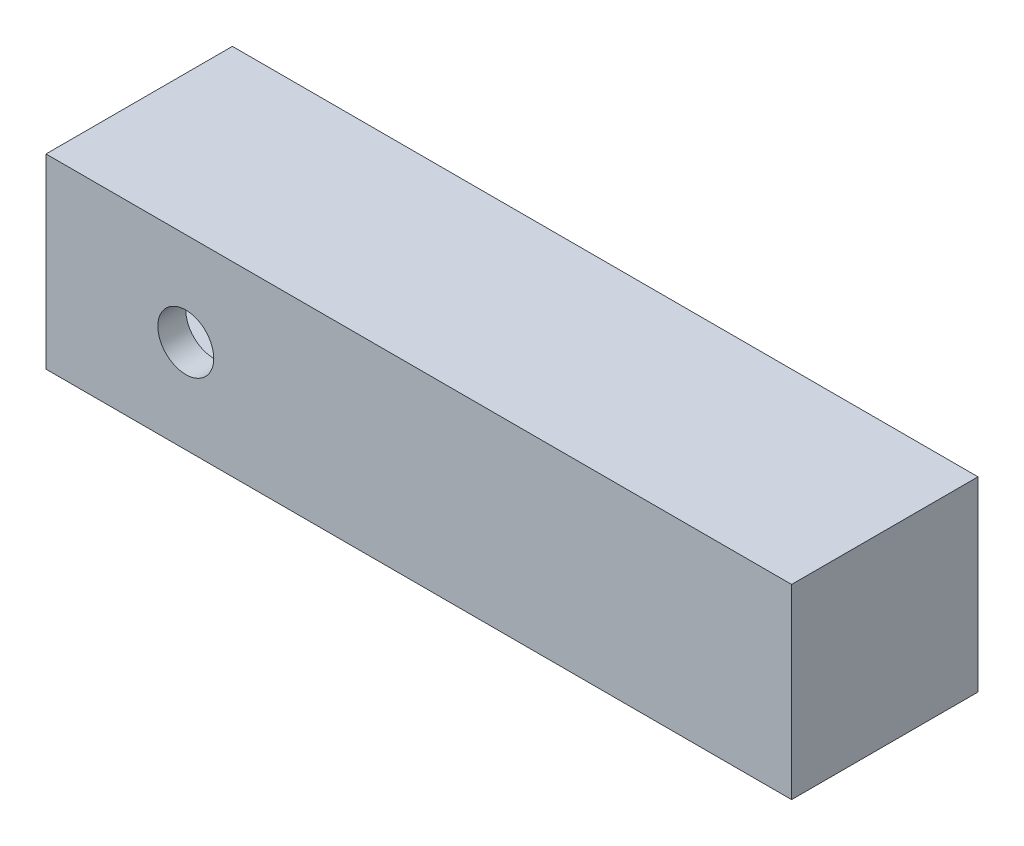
from build123d import *

# Parameters (mm, degrees)
SKETCH1_W               = 101.6
SKETCH1_H               = 25.4
BOSS_EXTRUDE1_DEPTH     = 12.7
SKETCH2_W               = 17.78
SKETCH2_H               = 17.78
CUT_EXTRUDE1_DEPTH      = 106.494123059
CUT_EXTRUDE1_DEPTH_BACK = 106.494123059
SKETCH9_R               = 3.81


with BuildPart() as part:
    # Sketch1 → Boss-Extrude1 (new, symmetric)
    with BuildSketch(Plane.XY):
        with Locations((50.8, -12.7)):
            Rectangle(SKETCH1_W, SKETCH1_H)
    extrude(amount=BOSS_EXTRUDE1_DEPTH, both=True)

    # Cut-Sweep2: sweep along a path in Sketch7
    with BuildLine(Plane.XY) as cut_sweep2_path:
        Line((0, -12.7), (72.517363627, -12.7))
        Line((72.517363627, -12.7), (72.517363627, -25.4))
    # Sketch2 → Cut-Sweep2 (sweep, cut)
    with BuildSketch(Plane.ZY):
        with Locations((0, -12.7)):
            Rectangle(SKETCH2_W, SKETCH2_H)
    sweep(path=cut_sweep2_path.line, transition=Transition.RIGHT, mode=Mode.SUBTRACT)

    # Sketch9 → Cut-Extrude1 (cut, two sides: drawn at the far end of the back side and taken through both)
    with BuildSketch(Plane.XY.offset(-CUT_EXTRUDE1_DEPTH_BACK)):
        with Locations((19.05, -12.7)):
            Circle(SKETCH9_R)
    extrude(amount=CUT_EXTRUDE1_DEPTH + CUT_EXTRUDE1_DEPTH_BACK, mode=Mode.SUBTRACT)


solid = part.part
